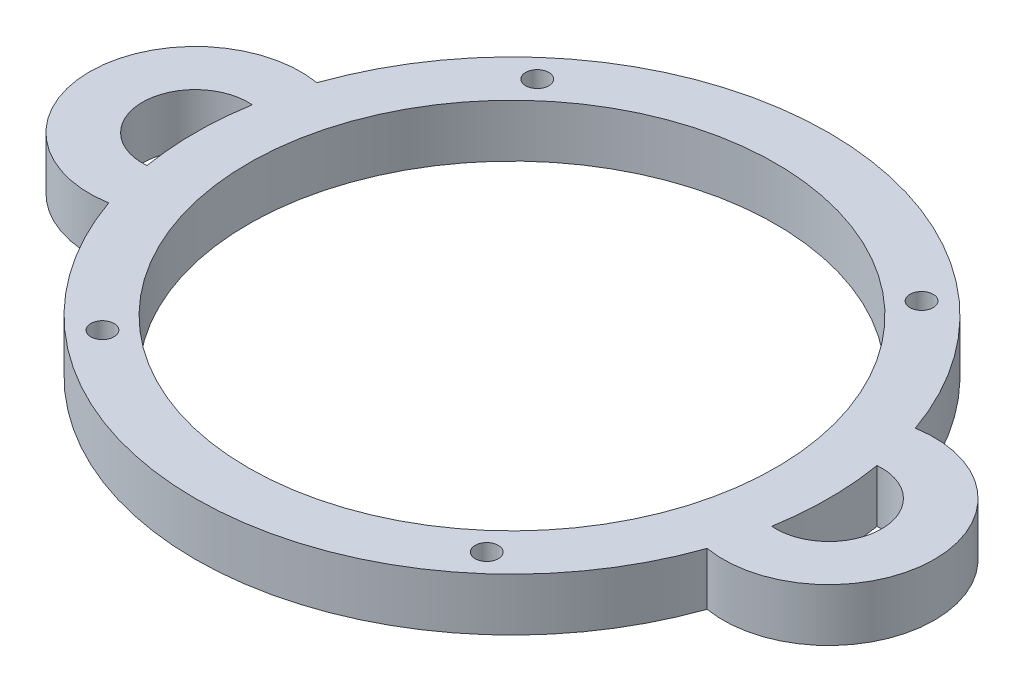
ISO-10303-21;
HEADER;
FILE_DESCRIPTION(('STEP AP214'),'2;1');
FILE_NAME('part.step','',(''),(''),'','','');
FILE_SCHEMA(('AUTOMOTIVE_DESIGN { 1 0 10303 214 1 1 1 1 }'));
ENDSEC;
DATA;
#1=APPLICATION_CONTEXT('core data for automotive mechanical design processes');
#2=APPLICATION_PROTOCOL_DEFINITION('international standard','automotive_design',2000,#1);
#3=PRODUCT_CONTEXT('',#1,'mechanical');
#4=PRODUCT('Part','Part','',(#3));
#5=PRODUCT_RELATED_PRODUCT_CATEGORY('part','',(#4));
#6=PRODUCT_DEFINITION_FORMATION('','',#4);
#7=PRODUCT_DEFINITION_CONTEXT('part definition',#1,'design');
#8=PRODUCT_DEFINITION('design','',#6,#7);
#9=PRODUCT_DEFINITION_SHAPE('','',#8);
#10=(LENGTH_UNIT() NAMED_UNIT(*) SI_UNIT(.MILLI.,.METRE.));
#11=(NAMED_UNIT(*) PLANE_ANGLE_UNIT() SI_UNIT($,.RADIAN.));
#12=(NAMED_UNIT(*) SI_UNIT($,.STERADIAN.) SOLID_ANGLE_UNIT());
#13=UNCERTAINTY_MEASURE_WITH_UNIT(LENGTH_MEASURE(1.E-05),#10,'distance_accuracy_value','');
#14=(GEOMETRIC_REPRESENTATION_CONTEXT(3) GLOBAL_UNCERTAINTY_ASSIGNED_CONTEXT((#13)) GLOBAL_UNIT_ASSIGNED_CONTEXT((#10,
#11,#12)) REPRESENTATION_CONTEXT('',''));
#15=CARTESIAN_POINT('',(0.,0.,0.));
#16=DIRECTION('',(0.,0.,1.));
#17=DIRECTION('',(1.,0.,0.));
#18=AXIS2_PLACEMENT_3D('',#15,#16,#17);
#19=CARTESIAN_POINT('',(-30.028463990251,10.,0.));
#20=DIRECTION('',(0.,1.,0.));
#21=DIRECTION('',(0.,0.,1.));
#22=AXIS2_PLACEMENT_3D('',#19,#20,#21);
#23=PLANE('',#22);
#24=CARTESIAN_POINT('',(-36.4296575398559,10.,41.2180144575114));
#25=DIRECTION('',(0.,1.,0.));
#26=DIRECTION('',(0.,0.,1.));
#27=AXIS2_PLACEMENT_3D('',#24,#25,#26);
#28=CIRCLE('',#27,2.2);
#29=CARTESIAN_POINT('',(-36.4296575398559,10.,43.4180144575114));
#30=VERTEX_POINT('',#29);
#31=EDGE_CURVE('E237',#30,#30,#28,.T.);
#32=ORIENTED_EDGE('',*,*,#31,.F.);
#33=EDGE_LOOP('',(#32));
#34=FACE_BOUND('',#33,.T.);
#35=CARTESIAN_POINT('',(-36.4296575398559,10.,-41.2180144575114));
#36=DIRECTION('',(0.,1.,0.));
#37=DIRECTION('',(0.,0.,1.));
#38=AXIS2_PLACEMENT_3D('',#35,#36,#37);
#39=CIRCLE('',#38,2.2);
#40=CARTESIAN_POINT('',(-36.4296575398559,10.,-39.0180144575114));
#41=VERTEX_POINT('',#40);
#42=EDGE_CURVE('E115',#41,#41,#39,.T.);
#43=ORIENTED_EDGE('',*,*,#42,.F.);
#44=EDGE_LOOP('',(#43));
#45=FACE_BOUND('',#44,.T.);
#46=CARTESIAN_POINT('',(-60.056927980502,10.,0.));
#47=DIRECTION('',(0.,1.,0.));
#48=DIRECTION('',(0.,0.,1.));
#49=AXIS2_PLACEMENT_3D('',#46,#47,#48);
#50=CIRCLE('',#49,10.0094879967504);
#51=CARTESIAN_POINT('',(-59.2228039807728,10.,-9.97467228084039));
#52=VERTEX_POINT('',#51);
#53=CARTESIAN_POINT('',(-59.2228039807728,10.,9.97467228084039));
#54=VERTEX_POINT('',#53);
#55=EDGE_CURVE('E122',#52,#54,#50,.T.);
#56=ORIENTED_EDGE('',*,*,#55,.F.);
#57=CARTESIAN_POINT('',(0.,10.,0.));
#58=DIRECTION('',(0.,-1.,0.));
#59=DIRECTION('',(0.,0.,1.));
#60=AXIS2_PLACEMENT_3D('',#57,#58,#59);
#61=CIRCLE('',#60,60.056927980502);
#62=EDGE_CURVE('E119',#54,#52,#61,.T.);
#63=ORIENTED_EDGE('',*,*,#62,.F.);
#64=EDGE_LOOP('',(#56,#63));
#65=FACE_BOUND('',#64,.T.);
#66=CARTESIAN_POINT('',(-60.056927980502,10.,0.));
#67=DIRECTION('',(0.,1.,0.));
#68=DIRECTION('',(0.,0.,1.));
#69=AXIS2_PLACEMENT_3D('',#66,#67,#68);
#70=CIRCLE('',#69,20.0189759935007);
#71=CARTESIAN_POINT('',(-56.7204319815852,10.,-19.7389765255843));
#72=VERTEX_POINT('',#71);
#73=CARTESIAN_POINT('',(-56.7204319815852,10.,19.7389765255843));
#74=VERTEX_POINT('',#73);
#75=EDGE_CURVE('E142',#72,#74,#70,.T.);
#76=ORIENTED_EDGE('',*,*,#75,.T.);
#77=CARTESIAN_POINT('',(0.,10.,0.));
#78=DIRECTION('',(0.,1.,0.));
#79=DIRECTION('',(0.,0.,1.));
#80=AXIS2_PLACEMENT_3D('',#77,#78,#79);
#81=CIRCLE('',#80,60.056927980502);
#82=CARTESIAN_POINT('',(56.7204319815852,10.,19.7389765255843));
#83=VERTEX_POINT('',#82);
#84=EDGE_CURVE('E145',#74,#83,#81,.T.);
#85=ORIENTED_EDGE('',*,*,#84,.T.);
#86=CARTESIAN_POINT('',(60.056927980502,10.,0.));
#87=DIRECTION('',(0.,1.,0.));
#88=DIRECTION('',(0.,0.,1.));
#89=AXIS2_PLACEMENT_3D('',#86,#87,#88);
#90=CIRCLE('',#89,20.0189759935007);
#91=CARTESIAN_POINT('',(56.7204319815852,10.,-19.7389765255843));
#92=VERTEX_POINT('',#91);
#93=EDGE_CURVE('E148',#83,#92,#90,.T.);
#94=ORIENTED_EDGE('',*,*,#93,.T.);
#95=CARTESIAN_POINT('',(0.,10.,0.));
#96=DIRECTION('',(0.,1.,0.));
#97=DIRECTION('',(0.,0.,1.));
#98=AXIS2_PLACEMENT_3D('',#95,#96,#97);
#99=CIRCLE('',#98,60.056927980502);
#100=EDGE_CURVE('E150',#92,#72,#99,.T.);
#101=ORIENTED_EDGE('',*,*,#100,.T.);
#102=EDGE_LOOP('',(#76,#85,#94,#101));
#103=FACE_BOUND('',#102,.T.);
#104=CARTESIAN_POINT('',(0.,10.,0.));
#105=DIRECTION('',(0.,1.,0.));
#106=DIRECTION('',(0.,0.,1.));
#107=AXIS2_PLACEMENT_3D('',#104,#105,#106);
#108=CIRCLE('',#107,50.);
#109=CARTESIAN_POINT('',(0.,10.,50.));
#110=VERTEX_POINT('',#109);
#111=EDGE_CURVE('E136',#110,#110,#108,.T.);
#112=ORIENTED_EDGE('',*,*,#111,.F.);
#113=EDGE_LOOP('',(#112));
#114=FACE_BOUND('',#113,.T.);
#115=CARTESIAN_POINT('',(60.056927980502,10.,0.));
#116=DIRECTION('',(0.,1.,0.));
#117=DIRECTION('',(0.,0.,1.));
#118=AXIS2_PLACEMENT_3D('',#115,#116,#117);
#119=CIRCLE('',#118,10.0094879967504);
#120=CARTESIAN_POINT('',(59.2228039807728,10.,9.97467228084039));
#121=VERTEX_POINT('',#120);
#122=CARTESIAN_POINT('',(59.2228039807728,10.,-9.97467228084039));
#123=VERTEX_POINT('',#122);
#124=EDGE_CURVE('E97',#121,#123,#119,.T.);
#125=ORIENTED_EDGE('',*,*,#124,.F.);
#126=CARTESIAN_POINT('',(0.,10.,0.));
#127=DIRECTION('',(0.,-1.,0.));
#128=DIRECTION('',(0.,0.,1.));
#129=AXIS2_PLACEMENT_3D('',#126,#127,#128);
#130=CIRCLE('',#129,60.056927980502);
#131=EDGE_CURVE('E103',#123,#121,#130,.T.);
#132=ORIENTED_EDGE('',*,*,#131,.F.);
#133=EDGE_LOOP('',(#125,#132));
#134=FACE_BOUND('',#133,.T.);
#135=CARTESIAN_POINT('',(36.4296575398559,10.,-41.2180144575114));
#136=DIRECTION('',(0.,1.,0.));
#137=DIRECTION('',(0.,0.,1.));
#138=AXIS2_PLACEMENT_3D('',#135,#136,#137);
#139=CIRCLE('',#138,2.2);
#140=CARTESIAN_POINT('',(36.4296575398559,10.,-39.0180144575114));
#141=VERTEX_POINT('',#140);
#142=EDGE_CURVE('E242',#141,#141,#139,.T.);
#143=ORIENTED_EDGE('',*,*,#142,.F.);
#144=EDGE_LOOP('',(#143));
#145=FACE_BOUND('',#144,.T.);
#146=CARTESIAN_POINT('',(36.4296575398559,10.,41.2180144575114));
#147=DIRECTION('',(0.,1.,0.));
#148=DIRECTION('',(0.,0.,1.));
#149=AXIS2_PLACEMENT_3D('',#146,#147,#148);
#150=CIRCLE('',#149,2.2);
#151=CARTESIAN_POINT('',(36.4296575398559,10.,43.4180144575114));
#152=VERTEX_POINT('',#151);
#153=EDGE_CURVE('E231',#152,#152,#150,.T.);
#154=ORIENTED_EDGE('',*,*,#153,.F.);
#155=EDGE_LOOP('',(#154));
#156=FACE_BOUND('',#155,.T.);
#157=ADVANCED_FACE('F33',(#34,#45,#65,#103,#114,#134,#145,#156),#23,.T.);
#158=CARTESIAN_POINT('',(-30.028463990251,0.,0.));
#159=DIRECTION('',(0.,1.,0.));
#160=DIRECTION('',(0.,0.,1.));
#161=AXIS2_PLACEMENT_3D('',#158,#159,#160);
#162=PLANE('',#161);
#163=CARTESIAN_POINT('',(-36.4296575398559,0.,41.2180144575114));
#164=DIRECTION('',(0.,1.,0.));
#165=DIRECTION('',(0.,0.,1.));
#166=AXIS2_PLACEMENT_3D('',#163,#164,#165);
#167=CIRCLE('',#166,2.2);
#168=CARTESIAN_POINT('',(-36.4296575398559,0.,43.4180144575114));
#169=VERTEX_POINT('',#168);
#170=EDGE_CURVE('E234',#169,#169,#167,.T.);
#171=ORIENTED_EDGE('',*,*,#170,.T.);
#172=EDGE_LOOP('',(#171));
#173=FACE_BOUND('',#172,.T.);
#174=CARTESIAN_POINT('',(-36.4296575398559,0.,-41.2180144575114));
#175=DIRECTION('',(0.,1.,0.));
#176=DIRECTION('',(0.,0.,1.));
#177=AXIS2_PLACEMENT_3D('',#174,#175,#176);
#178=CIRCLE('',#177,2.2);
#179=CARTESIAN_POINT('',(-36.4296575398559,0.,-39.0180144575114));
#180=VERTEX_POINT('',#179);
#181=EDGE_CURVE('E112',#180,#180,#178,.T.);
#182=ORIENTED_EDGE('',*,*,#181,.T.);
#183=EDGE_LOOP('',(#182));
#184=FACE_BOUND('',#183,.T.);
#185=CARTESIAN_POINT('',(0.,0.,0.));
#186=DIRECTION('',(0.,-1.,0.));
#187=DIRECTION('',(0.,0.,1.));
#188=AXIS2_PLACEMENT_3D('',#185,#186,#187);
#189=CIRCLE('',#188,60.056927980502);
#190=CARTESIAN_POINT('',(-59.2228039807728,0.,9.97467228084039));
#191=VERTEX_POINT('',#190);
#192=CARTESIAN_POINT('',(-59.2228039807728,0.,-9.97467228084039));
#193=VERTEX_POINT('',#192);
#194=EDGE_CURVE('E118',#191,#193,#189,.T.);
#195=ORIENTED_EDGE('',*,*,#194,.T.);
#196=CARTESIAN_POINT('',(-60.056927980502,0.,0.));
#197=DIRECTION('',(0.,1.,0.));
#198=DIRECTION('',(0.,0.,1.));
#199=AXIS2_PLACEMENT_3D('',#196,#197,#198);
#200=CIRCLE('',#199,10.0094879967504);
#201=EDGE_CURVE('E123',#193,#191,#200,.T.);
#202=ORIENTED_EDGE('',*,*,#201,.T.);
#203=EDGE_LOOP('',(#195,#202));
#204=FACE_BOUND('',#203,.T.);
#205=CARTESIAN_POINT('',(-60.056927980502,0.,0.));
#206=DIRECTION('',(0.,1.,0.));
#207=DIRECTION('',(0.,0.,1.));
#208=AXIS2_PLACEMENT_3D('',#205,#206,#207);
#209=CIRCLE('',#208,20.0189759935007);
#210=CARTESIAN_POINT('',(-56.7204319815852,0.,-19.7389765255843));
#211=VERTEX_POINT('',#210);
#212=CARTESIAN_POINT('',(-56.7204319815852,0.,19.7389765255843));
#213=VERTEX_POINT('',#212);
#214=EDGE_CURVE('E139',#211,#213,#209,.T.);
#215=ORIENTED_EDGE('',*,*,#214,.F.);
#216=CARTESIAN_POINT('',(0.,0.,0.));
#217=DIRECTION('',(0.,1.,0.));
#218=DIRECTION('',(0.,0.,1.));
#219=AXIS2_PLACEMENT_3D('',#216,#217,#218);
#220=CIRCLE('',#219,60.056927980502);
#221=CARTESIAN_POINT('',(56.7204319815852,0.,-19.7389765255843));
#222=VERTEX_POINT('',#221);
#223=EDGE_CURVE('E146',#222,#211,#220,.T.);
#224=ORIENTED_EDGE('',*,*,#223,.F.);
#225=CARTESIAN_POINT('',(60.056927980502,0.,0.));
#226=DIRECTION('',(0.,1.,0.));
#227=DIRECTION('',(0.,0.,1.));
#228=AXIS2_PLACEMENT_3D('',#225,#226,#227);
#229=CIRCLE('',#228,20.0189759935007);
#230=CARTESIAN_POINT('',(56.7204319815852,0.,19.7389765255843));
#231=VERTEX_POINT('',#230);
#232=EDGE_CURVE('E157',#231,#222,#229,.T.);
#233=ORIENTED_EDGE('',*,*,#232,.F.);
#234=CARTESIAN_POINT('',(0.,0.,0.));
#235=DIRECTION('',(0.,1.,0.));
#236=DIRECTION('',(0.,0.,1.));
#237=AXIS2_PLACEMENT_3D('',#234,#235,#236);
#238=CIRCLE('',#237,60.056927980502);
#239=EDGE_CURVE('E155',#213,#231,#238,.T.);
#240=ORIENTED_EDGE('',*,*,#239,.F.);
#241=EDGE_LOOP('',(#215,#224,#233,#240));
#242=FACE_BOUND('',#241,.T.);
#243=CARTESIAN_POINT('',(0.,0.,0.));
#244=DIRECTION('',(0.,1.,0.));
#245=DIRECTION('',(0.,0.,1.));
#246=AXIS2_PLACEMENT_3D('',#243,#244,#245);
#247=CIRCLE('',#246,50.);
#248=CARTESIAN_POINT('',(0.,0.,50.));
#249=VERTEX_POINT('',#248);
#250=EDGE_CURVE('E135',#249,#249,#247,.T.);
#251=ORIENTED_EDGE('',*,*,#250,.T.);
#252=EDGE_LOOP('',(#251));
#253=FACE_BOUND('',#252,.T.);
#254=CARTESIAN_POINT('',(0.,0.,0.));
#255=DIRECTION('',(0.,-1.,0.));
#256=DIRECTION('',(0.,0.,1.));
#257=AXIS2_PLACEMENT_3D('',#254,#255,#256);
#258=CIRCLE('',#257,60.056927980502);
#259=CARTESIAN_POINT('',(59.2228039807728,0.,-9.97467228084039));
#260=VERTEX_POINT('',#259);
#261=CARTESIAN_POINT('',(59.2228039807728,0.,9.97467228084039));
#262=VERTEX_POINT('',#261);
#263=EDGE_CURVE('E55',#260,#262,#258,.T.);
#264=ORIENTED_EDGE('',*,*,#263,.T.);
#265=CARTESIAN_POINT('',(60.056927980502,0.,0.));
#266=DIRECTION('',(0.,1.,0.));
#267=DIRECTION('',(0.,0.,1.));
#268=AXIS2_PLACEMENT_3D('',#265,#266,#267);
#269=CIRCLE('',#268,10.0094879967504);
#270=EDGE_CURVE('E108',#262,#260,#269,.T.);
#271=ORIENTED_EDGE('',*,*,#270,.T.);
#272=EDGE_LOOP('',(#264,#271));
#273=FACE_BOUND('',#272,.T.);
#274=CARTESIAN_POINT('',(36.4296575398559,0.,-41.2180144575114));
#275=DIRECTION('',(0.,1.,0.));
#276=DIRECTION('',(0.,0.,1.));
#277=AXIS2_PLACEMENT_3D('',#274,#275,#276);
#278=CIRCLE('',#277,2.2);
#279=CARTESIAN_POINT('',(36.4296575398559,0.,-39.0180144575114));
#280=VERTEX_POINT('',#279);
#281=EDGE_CURVE('E226',#280,#280,#278,.T.);
#282=ORIENTED_EDGE('',*,*,#281,.T.);
#283=EDGE_LOOP('',(#282));
#284=FACE_BOUND('',#283,.T.);
#285=CARTESIAN_POINT('',(36.4296575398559,0.,41.2180144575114));
#286=DIRECTION('',(0.,1.,0.));
#287=DIRECTION('',(0.,0.,1.));
#288=AXIS2_PLACEMENT_3D('',#285,#286,#287);
#289=CIRCLE('',#288,2.2);
#290=CARTESIAN_POINT('',(36.4296575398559,0.,43.4180144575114));
#291=VERTEX_POINT('',#290);
#292=EDGE_CURVE('E229',#291,#291,#289,.T.);
#293=ORIENTED_EDGE('',*,*,#292,.T.);
#294=EDGE_LOOP('',(#293));
#295=FACE_BOUND('',#294,.T.);
#296=ADVANCED_FACE('F175',(#173,#184,#204,#242,#253,#273,#284,#295),#162,.F.);
#297=CARTESIAN_POINT('',(-60.056927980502,10.,0.));
#298=DIRECTION('',(0.,-1.,0.));
#299=DIRECTION('',(0.,0.,-1.));
#300=AXIS2_PLACEMENT_3D('',#297,#298,#299);
#301=CYLINDRICAL_SURFACE('',#300,20.0189759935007);
#302=ORIENTED_EDGE('',*,*,#214,.T.);
#303=DIRECTION('',(0.,-1.,0.));
#304=VECTOR('',#303,1.);
#305=CARTESIAN_POINT('',(-56.7204319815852,10.,19.7389765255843));
#306=LINE('',#305,#304);
#307=EDGE_CURVE('E11',#74,#213,#306,.T.);
#308=ORIENTED_EDGE('',*,*,#307,.F.);
#309=ORIENTED_EDGE('',*,*,#75,.F.);
#310=DIRECTION('',(0.,-1.,0.));
#311=VECTOR('',#310,1.);
#312=CARTESIAN_POINT('',(-56.7204319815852,10.,-19.7389765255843));
#313=LINE('',#312,#311);
#314=EDGE_CURVE('E152',#72,#211,#313,.T.);
#315=ORIENTED_EDGE('',*,*,#314,.T.);
#316=EDGE_LOOP('',(#302,#308,#309,#315));
#317=FACE_BOUND('',#316,.T.);
#318=ADVANCED_FACE('F35',(#317),#301,.T.);
#319=CARTESIAN_POINT('',(0.,10.,0.));
#320=DIRECTION('',(0.,-1.,0.));
#321=DIRECTION('',(0.,0.,-1.));
#322=AXIS2_PLACEMENT_3D('',#319,#320,#321);
#323=CYLINDRICAL_SURFACE('',#322,60.056927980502);
#324=ORIENTED_EDGE('',*,*,#239,.T.);
#325=DIRECTION('',(0.,-1.,0.));
#326=VECTOR('',#325,1.);
#327=CARTESIAN_POINT('',(56.7204319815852,10.,19.7389765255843));
#328=LINE('',#327,#326);
#329=EDGE_CURVE('E41',#83,#231,#328,.T.);
#330=ORIENTED_EDGE('',*,*,#329,.F.);
#331=ORIENTED_EDGE('',*,*,#84,.F.);
#332=ORIENTED_EDGE('',*,*,#307,.T.);
#333=EDGE_LOOP('',(#324,#330,#331,#332));
#334=FACE_BOUND('',#333,.T.);
#335=ADVANCED_FACE('F186',(#334),#323,.T.);
#336=CARTESIAN_POINT('',(60.056927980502,10.,0.));
#337=DIRECTION('',(0.,-1.,0.));
#338=DIRECTION('',(0.,0.,-1.));
#339=AXIS2_PLACEMENT_3D('',#336,#337,#338);
#340=CYLINDRICAL_SURFACE('',#339,20.0189759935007);
#341=ORIENTED_EDGE('',*,*,#232,.T.);
#342=DIRECTION('',(0.,-1.,0.));
#343=VECTOR('',#342,1.);
#344=CARTESIAN_POINT('',(56.7204319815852,10.,-19.7389765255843));
#345=LINE('',#344,#343);
#346=EDGE_CURVE('E162',#92,#222,#345,.T.);
#347=ORIENTED_EDGE('',*,*,#346,.F.);
#348=ORIENTED_EDGE('',*,*,#93,.F.);
#349=ORIENTED_EDGE('',*,*,#329,.T.);
#350=EDGE_LOOP('',(#341,#347,#348,#349));
#351=FACE_BOUND('',#350,.T.);
#352=ADVANCED_FACE('F169',(#351),#340,.T.);
#353=CARTESIAN_POINT('',(0.,10.,0.));
#354=DIRECTION('',(0.,-1.,0.));
#355=DIRECTION('',(0.,0.,-1.));
#356=AXIS2_PLACEMENT_3D('',#353,#354,#355);
#357=CYLINDRICAL_SURFACE('',#356,60.056927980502);
#358=ORIENTED_EDGE('',*,*,#223,.T.);
#359=ORIENTED_EDGE('',*,*,#314,.F.);
#360=ORIENTED_EDGE('',*,*,#100,.F.);
#361=ORIENTED_EDGE('',*,*,#346,.T.);
#362=EDGE_LOOP('',(#358,#359,#360,#361));
#363=FACE_BOUND('',#362,.T.);
#364=ADVANCED_FACE('F179',(#363),#357,.T.);
#365=CARTESIAN_POINT('',(0.,10.,0.));
#366=DIRECTION('',(0.,-1.,0.));
#367=DIRECTION('',(0.,0.,-1.));
#368=AXIS2_PLACEMENT_3D('',#365,#366,#367);
#369=CYLINDRICAL_SURFACE('',#368,50.);
#370=ORIENTED_EDGE('',*,*,#111,.T.);
#371=EDGE_LOOP('',(#370));
#372=FACE_BOUND('',#371,.T.);
#373=ORIENTED_EDGE('',*,*,#250,.F.);
#374=EDGE_LOOP('',(#373));
#375=FACE_BOUND('',#374,.T.);
#376=ADVANCED_FACE('F204',(#372,#375),#369,.F.);
#377=CARTESIAN_POINT('',(0.,10.,0.));
#378=DIRECTION('',(0.,-1.,0.));
#379=DIRECTION('',(0.,0.,-1.));
#380=AXIS2_PLACEMENT_3D('',#377,#378,#379);
#381=CYLINDRICAL_SURFACE('',#380,60.056927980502);
#382=ORIENTED_EDGE('',*,*,#194,.F.);
#383=DIRECTION('',(0.,-1.,0.));
#384=VECTOR('',#383,1.);
#385=CARTESIAN_POINT('',(-59.2228039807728,10.,9.97467228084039));
#386=LINE('',#385,#384);
#387=EDGE_CURVE('E125',#54,#191,#386,.T.);
#388=ORIENTED_EDGE('',*,*,#387,.F.);
#389=ORIENTED_EDGE('',*,*,#62,.T.);
#390=DIRECTION('',(0.,-1.,0.));
#391=VECTOR('',#390,1.);
#392=CARTESIAN_POINT('',(-59.2228039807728,10.,-9.97467228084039));
#393=LINE('',#392,#391);
#394=EDGE_CURVE('E132',#52,#193,#393,.T.);
#395=ORIENTED_EDGE('',*,*,#394,.T.);
#396=EDGE_LOOP('',(#382,#388,#389,#395));
#397=FACE_BOUND('',#396,.T.);
#398=ADVANCED_FACE('F211',(#397),#381,.T.);
#399=CARTESIAN_POINT('',(-60.056927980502,10.,0.));
#400=DIRECTION('',(0.,-1.,0.));
#401=DIRECTION('',(0.,0.,-1.));
#402=AXIS2_PLACEMENT_3D('',#399,#400,#401);
#403=CYLINDRICAL_SURFACE('',#402,10.0094879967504);
#404=ORIENTED_EDGE('',*,*,#201,.F.);
#405=ORIENTED_EDGE('',*,*,#394,.F.);
#406=ORIENTED_EDGE('',*,*,#55,.T.);
#407=ORIENTED_EDGE('',*,*,#387,.T.);
#408=EDGE_LOOP('',(#404,#405,#406,#407));
#409=FACE_BOUND('',#408,.T.);
#410=ADVANCED_FACE('F216',(#409),#403,.F.);
#411=CARTESIAN_POINT('',(0.,10.,0.));
#412=DIRECTION('',(0.,-1.,0.));
#413=DIRECTION('',(0.,0.,-1.));
#414=AXIS2_PLACEMENT_3D('',#411,#412,#413);
#415=CYLINDRICAL_SURFACE('',#414,60.056927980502);
#416=ORIENTED_EDGE('',*,*,#263,.F.);
#417=DIRECTION('',(0.,-1.,0.));
#418=VECTOR('',#417,1.);
#419=CARTESIAN_POINT('',(59.2228039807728,10.,-9.97467228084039));
#420=LINE('',#419,#418);
#421=EDGE_CURVE('E99',#123,#260,#420,.T.);
#422=ORIENTED_EDGE('',*,*,#421,.F.);
#423=ORIENTED_EDGE('',*,*,#131,.T.);
#424=DIRECTION('',(0.,-1.,0.));
#425=VECTOR('',#424,1.);
#426=CARTESIAN_POINT('',(59.2228039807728,10.,9.97467228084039));
#427=LINE('',#426,#425);
#428=EDGE_CURVE('E48',#121,#262,#427,.T.);
#429=ORIENTED_EDGE('',*,*,#428,.T.);
#430=EDGE_LOOP('',(#416,#422,#423,#429));
#431=FACE_BOUND('',#430,.T.);
#432=ADVANCED_FACE('F105',(#431),#415,.T.);
#433=CARTESIAN_POINT('',(60.056927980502,10.,0.));
#434=DIRECTION('',(0.,-1.,0.));
#435=DIRECTION('',(0.,0.,-1.));
#436=AXIS2_PLACEMENT_3D('',#433,#434,#435);
#437=CYLINDRICAL_SURFACE('',#436,10.0094879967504);
#438=ORIENTED_EDGE('',*,*,#270,.F.);
#439=ORIENTED_EDGE('',*,*,#428,.F.);
#440=ORIENTED_EDGE('',*,*,#124,.T.);
#441=ORIENTED_EDGE('',*,*,#421,.T.);
#442=EDGE_LOOP('',(#438,#439,#440,#441));
#443=FACE_BOUND('',#442,.T.);
#444=ADVANCED_FACE('F98',(#443),#437,.F.);
#445=CARTESIAN_POINT('',(-36.4296575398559,10.,-41.2180144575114));
#446=DIRECTION('',(0.,-1.,0.));
#447=DIRECTION('',(0.,0.,-1.));
#448=AXIS2_PLACEMENT_3D('',#445,#446,#447);
#449=CYLINDRICAL_SURFACE('',#448,2.2);
#450=ORIENTED_EDGE('',*,*,#42,.T.);
#451=EDGE_LOOP('',(#450));
#452=FACE_BOUND('',#451,.T.);
#453=ORIENTED_EDGE('',*,*,#181,.F.);
#454=EDGE_LOOP('',(#453));
#455=FACE_BOUND('',#454,.T.);
#456=ADVANCED_FACE('F253',(#452,#455),#449,.F.);
#457=CARTESIAN_POINT('',(36.4296575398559,10.,-41.2180144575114));
#458=DIRECTION('',(0.,-1.,0.));
#459=DIRECTION('',(0.,0.,-1.));
#460=AXIS2_PLACEMENT_3D('',#457,#458,#459);
#461=CYLINDRICAL_SURFACE('',#460,2.2);
#462=ORIENTED_EDGE('',*,*,#142,.T.);
#463=EDGE_LOOP('',(#462));
#464=FACE_BOUND('',#463,.T.);
#465=ORIENTED_EDGE('',*,*,#281,.F.);
#466=EDGE_LOOP('',(#465));
#467=FACE_BOUND('',#466,.T.);
#468=ADVANCED_FACE('F255',(#464,#467),#461,.F.);
#469=CARTESIAN_POINT('',(-36.4296575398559,10.,41.2180144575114));
#470=DIRECTION('',(0.,-1.,0.));
#471=DIRECTION('',(0.,0.,-1.));
#472=AXIS2_PLACEMENT_3D('',#469,#470,#471);
#473=CYLINDRICAL_SURFACE('',#472,2.2);
#474=ORIENTED_EDGE('',*,*,#31,.T.);
#475=EDGE_LOOP('',(#474));
#476=FACE_BOUND('',#475,.T.);
#477=ORIENTED_EDGE('',*,*,#170,.F.);
#478=EDGE_LOOP('',(#477));
#479=FACE_BOUND('',#478,.T.);
#480=ADVANCED_FACE('F261',(#476,#479),#473,.F.);
#481=CARTESIAN_POINT('',(36.4296575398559,10.,41.2180144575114));
#482=DIRECTION('',(0.,-1.,0.));
#483=DIRECTION('',(0.,0.,-1.));
#484=AXIS2_PLACEMENT_3D('',#481,#482,#483);
#485=CYLINDRICAL_SURFACE('',#484,2.2);
#486=ORIENTED_EDGE('',*,*,#153,.T.);
#487=EDGE_LOOP('',(#486));
#488=FACE_BOUND('',#487,.T.);
#489=ORIENTED_EDGE('',*,*,#292,.F.);
#490=EDGE_LOOP('',(#489));
#491=FACE_BOUND('',#490,.T.);
#492=ADVANCED_FACE('F306',(#488,#491),#485,.F.);
#493=CLOSED_SHELL('',(#157,#296,#318,#335,#352,#364,#376,#398,#410,#432,#444,#456,#468,#480,#492));
#494=MANIFOLD_SOLID_BREP('B2',#493);
#495=ADVANCED_BREP_SHAPE_REPRESENTATION('',(#18,#494),#14);
#496=SHAPE_DEFINITION_REPRESENTATION(#9,#495);
ENDSEC;
END-ISO-10303-21;
